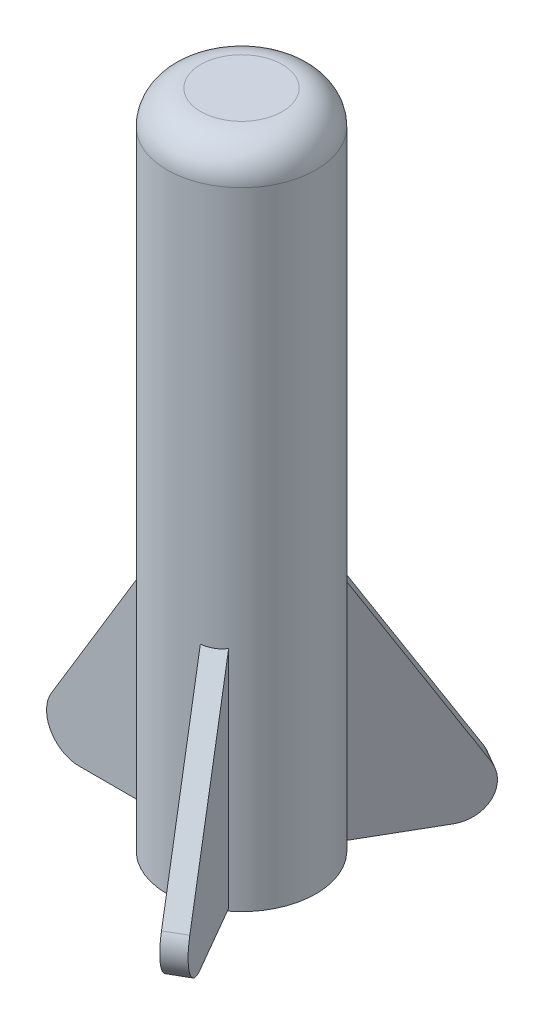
from build123d import *

# Parameters (mm, degrees)
SKETCH1_R           = 7.3025
BASE_EXTRUDE_DEPTH  = 64.77
FILLET1_R           = 3.302
SKETCH2_R           = 2.794
CUT_EXTRUDE1_DEPTH  = 34.29
BOSS_EXTRUDE1_DEPTH = 1.016
CIRPATTERN1_COUNT   = 3


with BuildPart() as part:
    # Sketch1 → Base-Extrude (new body)
    with BuildSketch(Plane(origin=(0, 0, 0), x_dir=(1, 0, 0), z_dir=(0, 1, 0))):
        with Locations(Location((0, 0, 0), (0, 0, 270))):
            Circle(SKETCH1_R)
    extrude(amount=BASE_EXTRUDE_DEPTH)

    # Fillet1
    fillet1_edges = [part.edges().sort_by_distance(p)[0] for p in [
        (0, 64.77, -7.3025),
    ]]
    fillet(fillet1_edges, radius=FILLET1_R)

    # Sketch2 → Cut-Extrude1 (cut)
    with BuildSketch(Plane.XZ):
        with Locations(Location((0, 0, 0), (0, 0, 270))):
            Circle(SKETCH2_R)
    extrude(amount=-CUT_EXTRUDE1_DEPTH, mode=Mode.SUBTRACT)

    # Sketch3 → Boss-Extrude1 (add, symmetric)
    with BuildSketch(Plane.XY):
        with BuildLine():
            Line((-7.0485, 0.254), (-14.9225, 0.254))
            ThreePointArc((-14.9225, 0.254), (-17.687687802, 1.868755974), (-17.640211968, 5.070543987))
            Line((-17.640211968, 5.070543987), (-7.0485, 22.606))
            Line((-7.0485, 22.606), (-7.0485, 0.254))
        make_face()
    boss_extrude1 = extrude(amount=BOSS_EXTRUDE1_DEPTH, both=True)

    # CirPattern1: Boss-Extrude1 ×3 about axis
    cirpattern1_axis = Axis((0, 0, 0), (0, 1, 0))
    for i in range(1, CIRPATTERN1_COUNT):
        add(boss_extrude1.rotate(cirpattern1_axis, i * 360 / CIRPATTERN1_COUNT))


solid = part.part
